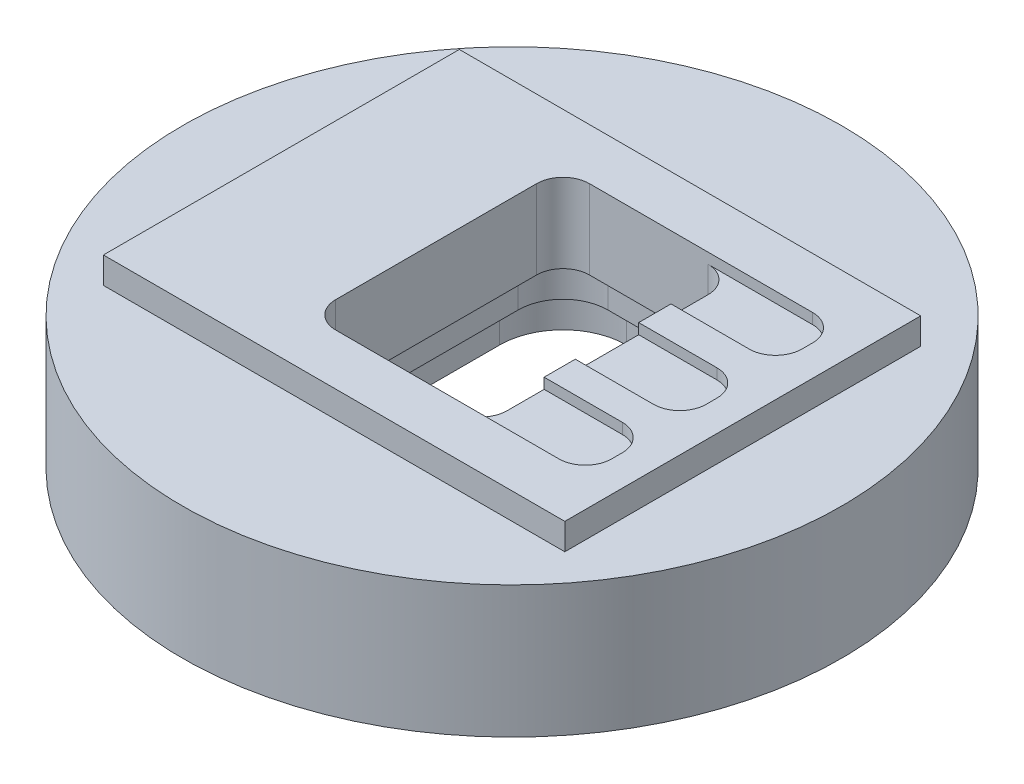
from build123d import *

# Parameters (mm, degrees)
SKETCH1_R                                = 3.175
PYREX_BASE_DEPTH                         = 1.524
INITIAL_CUTOUT_FOR_TRACE_CLEARANCE_DEPTH = 0.1016
THROUGH_ALL_CAVITY_DEPTH                 = 5.741711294
DIE_START                                = -0.254
SKETCH4_R                                = 3.175
SKETCH4_W                                = 4.445
SKETCH4_H                                = 3.429
DIE_ALIGNMENT_CUTOUT_DEPTH               = 0.254
CUT_EXTRUDE1_DEPTH                       = 0.762
CUT_EXTRUDE2_DEPTH                       = 0.381


with BuildPart() as part:
    # Sketch1 → pyrex base (new body)
    with BuildSketch(Plane(origin=(0, 0, 0), x_dir=(1, 0, 0), z_dir=(0, 1, 0))):
        with Locations(Location((0, 0, 0), (0, 0, 90))):
            Circle(SKETCH1_R)
    extrude(amount=PYREX_BASE_DEPTH)

    # Sketch2 → initial cutout for trace clearance (cut)
    with BuildSketch(Plane(origin=(0, 1.524, 0), x_dir=(1, 0, 0), z_dir=(0, 1, 0))):
        with BuildLine():
            Line((-0.477012, -1.2219051), (1.673098, -1.2219051))
            ThreePointArc((1.673098, -1.2219051), (1.852703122, -1.147510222), (1.927098, -0.9679051))
            Line((1.927098, -0.9679051), (1.927098, -0.8651113))
            ThreePointArc((1.927098, -0.8651113), (1.852703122, -0.685506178), (1.673098, -0.6111113))
            Line((1.673098, -0.6111113), (0.4919853, -0.6111113))
            ThreePointArc((0.4919853, -0.6111113), (0.341884, -0.46101), (0.4919853, -0.3109087))
            Line((0.4919853, -0.3109087), (1.673098, -0.3109087))
            ThreePointArc((1.673098, -0.3109087), (1.852703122, -0.236513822), (1.927098, -0.0569087))
            Line((1.927098, -0.0569087), (1.927098, 0.0458851))
            ThreePointArc((1.927098, 0.0458851), (1.852703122, 0.225490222), (1.673098, 0.2998851))
            Line((1.673098, 0.2998851), (0.4919853, 0.2998851))
            ThreePointArc((0.4919853, 0.2998851), (0.3363722, 0.4554982), (0.4919853, 0.6111113))
            Line((0.4919853, 0.6111113), (1.673098, 0.6111113))
            ThreePointArc((1.673098, 0.6111113), (1.852703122, 0.685506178), (1.927098, 0.8651113))
            Line((1.927098, 0.8651113), (1.927098, 0.9679051))
            ThreePointArc((1.927098, 0.9679051), (1.852703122, 1.147510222), (1.673098, 1.2219051))
            Line((1.673098, 1.2219051), (-0.477012, 1.2219051))
            ThreePointArc((-0.477012, 1.2219051), (-0.656617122, 1.147510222), (-0.731012, 0.9679051))
            Line((-0.731012, 0.9679051), (-0.731012, -0.9679051))
            ThreePointArc((-0.731012, -0.9679051), (-0.656617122, -1.147510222), (-0.477012, -1.2219051))
        make_face()
    extrude(amount=-INITIAL_CUTOUT_FOR_TRACE_CLEARANCE_DEPTH, mode=Mode.SUBTRACT)

    # Sketch3 → through all cavity (cut, through all)
    with BuildSketch(Plane.XZ):
        with BuildLine():
            Line((-0.731012, -0.9679051), (-0.731012, 0.9679051))
            ThreePointArc((-0.731012, 0.9679051), (-0.656617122, 1.147510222), (-0.477012, 1.2219051))
            Line((-0.477012, 1.2219051), (0.665988, 1.2219051))
            ThreePointArc((0.665988, 1.2219051), (0.845593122, 1.147510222), (0.919988, 0.9679051))
            Line((0.919988, 0.9679051), (0.919988, -0.9679051))
            ThreePointArc((0.919988, -0.9679051), (0.845593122, -1.147510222), (0.665988, -1.2219051))
            Line((0.665988, -1.2219051), (-0.477012, -1.2219051))
            ThreePointArc((-0.477012, -1.2219051), (-0.656617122, -1.147510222), (-0.731012, -0.9679051))
        make_face()
    extrude(amount=-THROUGH_ALL_CAVITY_DEPTH, mode=Mode.SUBTRACT)

    # Sketch4 → die alignment cutout (cut)
    with BuildSketch(Plane(origin=(0, 1.524, 0), x_dir=(1, 0, 0), z_dir=(0, 1, 0)).offset(DIE_START)):
        with Locations(Location((0, 0, 0), (0, 0, 90))):
            Circle(SKETCH4_R)
        Rectangle(SKETCH4_W, SKETCH4_H, mode=Mode.SUBTRACT)
    extrude(amount=DIE_ALIGNMENT_CUTOUT_DEPTH, mode=Mode.SUBTRACT)

    # Sketch5 → Cut-Extrude1 (cut)
    with BuildSketch(Plane.XZ):
        with BuildLine():
            Line((0.665988, 1.3997051), (-0.477012, 1.3997051))
            ThreePointArc((-0.477012, 1.3997051), (-0.782340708, 1.273233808), (-0.908812, 0.9679051))
            Line((-0.908812, 0.9679051), (-0.908812, -0.9679051))
            ThreePointArc((-0.908812, -0.9679051), (-0.782340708, -1.273233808), (-0.477012, -1.3997051))
            Line((-0.477012, -1.3997051), (0.665988, -1.3997051))
            ThreePointArc((0.665988, -1.3997051), (0.971316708, -1.273233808), (1.097788, -0.9679051))
            Line((1.097788, -0.9679051), (1.097788, 0.9679051))
            ThreePointArc((1.097788, 0.9679051), (0.971316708, 1.273233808), (0.665988, 1.3997051))
        make_face()
    extrude(amount=-CUT_EXTRUDE1_DEPTH, mode=Mode.SUBTRACT)

    # Sketch6 → Cut-Extrude2 (cut)
    with BuildSketch(Plane.XZ):
        with BuildLine():
            Line((-0.477012, -1.5775051), (0.665988, -1.5775051))
            ThreePointArc((0.665988, -1.5775051), (1.097040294, -1.398957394), (1.275588, -0.9679051))
            Line((1.275588, -0.9679051), (1.275588, 0.9679051))
            ThreePointArc((1.275588, 0.9679051), (1.097040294, 1.398957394), (0.665988, 1.5775051))
            Line((0.665988, 1.5775051), (-0.477012, 1.5775051))
            ThreePointArc((-0.477012, 1.5775051), (-0.908064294, 1.398957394), (-1.086612, 0.9679051))
            Line((-1.086612, 0.9679051), (-1.086612, -0.9679051))
            ThreePointArc((-1.086612, -0.9679051), (-0.908064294, -1.398957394), (-0.477012, -1.5775051))
        make_face()
    extrude(amount=-CUT_EXTRUDE2_DEPTH, mode=Mode.SUBTRACT)


solid = part.part
